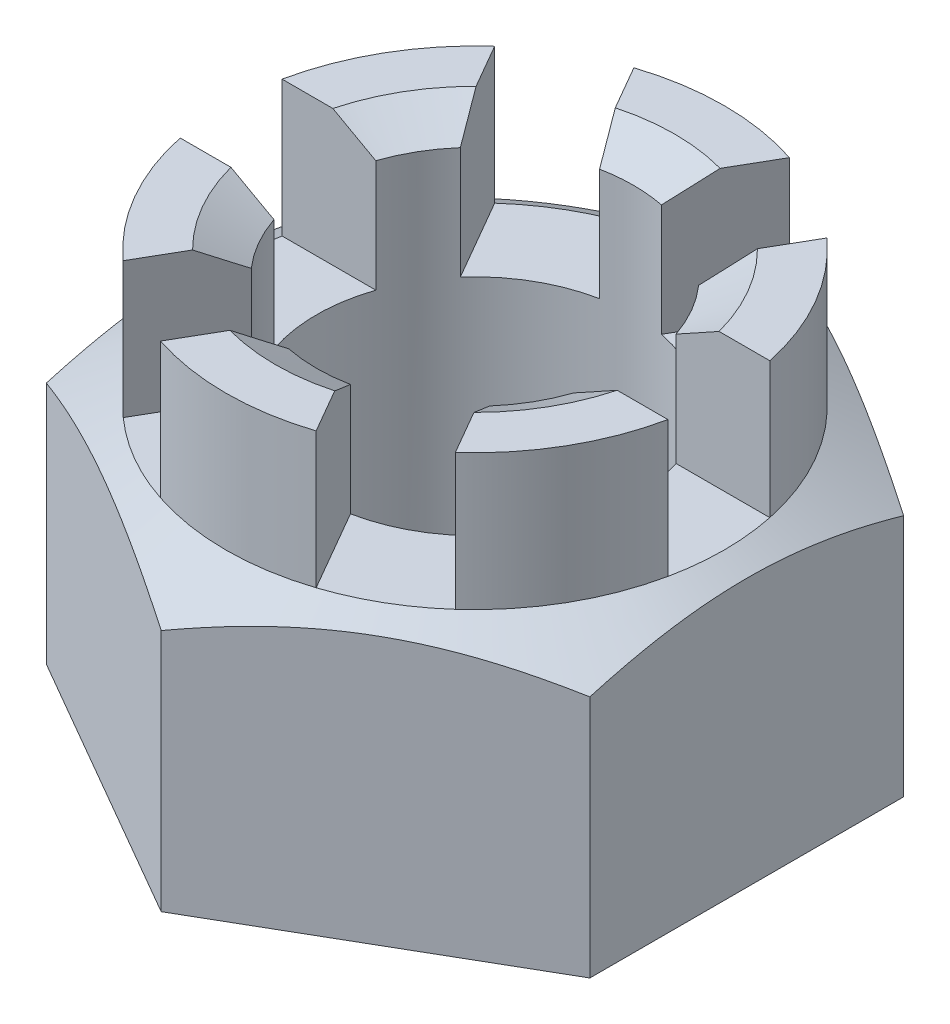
from build123d import *

# Parameters (mm, degrees)
BASENUT_DEPTH    = 19
HOLESKE_R        = 7
TAPPEDHOLE_DEPTH = 27.400757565
CHAMFER1_SIZE    = 1.05
CHAMFER1_SIZE2   = 1.818653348
SLOTSKE_W        = 4.5
SLOTSKE_H        = 19
SLOT_DEPTH       = 28.8
SLOTPAT_COUNT    = 6
CUTBOTTOMSKE_R   = 22.3
CUTBOTTOMSKE_R_2 = 11.15
CUTBOTTOM_DEPTH  = 0.6


with BuildPart() as part:
    # BaseNutSke → BaseNut (new body)
    with BuildSketch(Plane(origin=(0, 0, 0), x_dir=(1, 0, 0), z_dir=(0, 1, 0))):
        Polygon((0, 13.856406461), (-12, 6.92820323), (-12, -6.92820323), (0, -13.856406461), (12, -6.92820323), (12, 6.92820323), align=None)
    extrude(amount=BASENUT_DEPTH)

    # CutNutSke → CutNut (revolve, cut)
    with BuildSketch(Plane(origin=(0, 0, 0), x_dir=(0, 0, -1), z_dir=(1, 0, 0)), mode=Mode.PRIVATE) as cutnut_sk:
        Polygon((-13.856406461, 19), (-11.5, 19), (-13.856406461, 17.639528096), align=None)
    revolve(cutnut_sk.sketch.rotate(Axis((0, 0, 0), (0, 1, 0)), 180), axis=Axis((0, 0, 0), (0, 1, 0)), mode=Mode.SUBTRACT)

    # HoleSke → TappedHole (cut, through all)
    with BuildSketch(Plane(origin=(0, 0, 0), x_dir=(1, 0, 0), z_dir=(0, 1, 0))):
        with Locations(Location((0, 0, 0), (0, 0, 270))):
            Circle(HOLESKE_R)
    extrude(amount=TAPPEDHOLE_DEPTH, mode=Mode.SUBTRACT)

    # Chamfer1
    chamfer1_edges = [part.edges().sort_by_distance(p)[0] for p in [
        (0, 0, -7),
        (0, 19, -7),
    ]]
    chamfer1_side = [part.faces().sort_by_distance(p)[0] for p in [
        (0, 9.5, -7),
    ]]
    chamfer(chamfer1_edges, length=CHAMFER1_SIZE, length2=CHAMFER1_SIZE2, reference=chamfer1_side[0])

    # SlotSke → Slot (cut)
    with BuildSketch(Plane(origin=(0, 0, 0), x_dir=(0, 0, -1), z_dir=(1, 0, 0))):
        with Locations((0, 22.5)):
            Rectangle(SLOTSKE_W, SLOTSKE_H)
    slot = extrude(amount=-SLOT_DEPTH, mode=Mode.SUBTRACT)

    # SlotPat: Slot ×6 about axis
    slotpat_axis = Axis((0, 0, 0), (0, 1, 0))
    for i in range(1, SLOTPAT_COUNT):
        add(slot.rotate(slotpat_axis, i * 360 / SLOTPAT_COUNT), mode=Mode.SUBTRACT)

    # TopCutSke → TopCut (revolve, cut)
    with BuildSketch(Plane(origin=(0, 0, 0), x_dir=(0, 0, -1), z_dir=(1, 0, 0)), mode=Mode.PRIVATE) as topcut_sk:
        Polygon((-11, 32), (-11, 13), (-33.516660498, 0), (-33.516660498, 32), align=None)
    revolve(topcut_sk.sketch.rotate(Axis((0, 0, 0), (0, 1, 0)), 180), axis=Axis((0, 0, 0), (0, 1, 0)), mode=Mode.SUBTRACT)

    # CutBottomSke → CutBottom (cut)
    with BuildSketch(Plane(origin=(0, 0, 0), x_dir=(1, 0, 0), z_dir=(0, 1, 0))):
        Circle(CUTBOTTOMSKE_R)
        with Locations(Location((0, 0, 0), (0, 0, 270))):
            Circle(CUTBOTTOMSKE_R_2, mode=Mode.SUBTRACT)
    extrude(amount=CUTBOTTOM_DEPTH, mode=Mode.SUBTRACT)


solid = part.part
